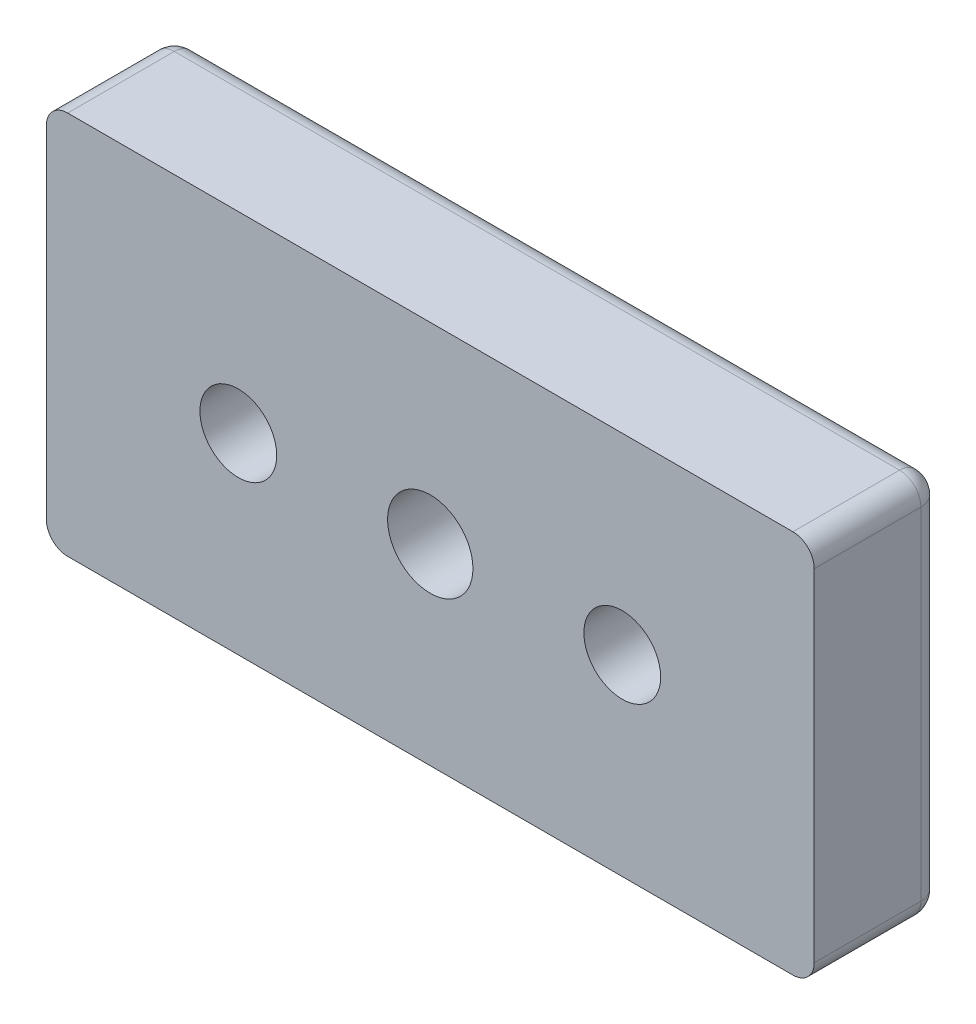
ISO-10303-21;
HEADER;
FILE_DESCRIPTION(('STEP AP214'),'2;1');
FILE_NAME('part.step','',(''),(''),'','','');
FILE_SCHEMA(('AUTOMOTIVE_DESIGN { 1 0 10303 214 1 1 1 1 }'));
ENDSEC;
DATA;
#1=APPLICATION_CONTEXT('core data for automotive mechanical design processes');
#2=APPLICATION_PROTOCOL_DEFINITION('international standard','automotive_design',2000,#1);
#3=PRODUCT_CONTEXT('',#1,'mechanical');
#4=PRODUCT('Part','Part','',(#3));
#5=PRODUCT_RELATED_PRODUCT_CATEGORY('part','',(#4));
#6=PRODUCT_DEFINITION_FORMATION('','',#4);
#7=PRODUCT_DEFINITION_CONTEXT('part definition',#1,'design');
#8=PRODUCT_DEFINITION('design','',#6,#7);
#9=PRODUCT_DEFINITION_SHAPE('','',#8);
#10=(LENGTH_UNIT() NAMED_UNIT(*) SI_UNIT(.MILLI.,.METRE.));
#11=(NAMED_UNIT(*) PLANE_ANGLE_UNIT() SI_UNIT($,.RADIAN.));
#12=(NAMED_UNIT(*) SI_UNIT($,.STERADIAN.) SOLID_ANGLE_UNIT());
#13=UNCERTAINTY_MEASURE_WITH_UNIT(LENGTH_MEASURE(1.E-05),#10,'distance_accuracy_value','');
#14=(GEOMETRIC_REPRESENTATION_CONTEXT(3) GLOBAL_UNCERTAINTY_ASSIGNED_CONTEXT((#13)) GLOBAL_UNIT_ASSIGNED_CONTEXT((#10,
#11,#12)) REPRESENTATION_CONTEXT('',''));
#15=CARTESIAN_POINT('',(0.,0.,0.));
#16=DIRECTION('',(0.,0.,1.));
#17=DIRECTION('',(1.,0.,0.));
#18=AXIS2_PLACEMENT_3D('',#15,#16,#17);
#19=CARTESIAN_POINT('',(22.5,0.,0.));
#20=DIRECTION('',(0.,0.,1.));
#21=DIRECTION('',(1.,0.,0.));
#22=AXIS2_PLACEMENT_3D('',#19,#20,#21);
#23=CYLINDRICAL_SURFACE('',#22,7.5);
#24=CARTESIAN_POINT('',(22.5,0.,5.5));
#25=DIRECTION('',(0.,0.,1.));
#26=DIRECTION('',(1.,0.,0.));
#27=AXIS2_PLACEMENT_3D('',#24,#25,#26);
#28=CIRCLE('',#27,7.5);
#29=CARTESIAN_POINT('',(30.,0.,5.5));
#30=VERTEX_POINT('',#29);
#31=EDGE_CURVE('E111',#30,#30,#28,.T.);
#32=ORIENTED_EDGE('',*,*,#31,.T.);
#33=EDGE_LOOP('',(#32));
#34=FACE_BOUND('',#33,.T.);
#35=CARTESIAN_POINT('',(22.5,0.,0.));
#36=DIRECTION('',(0.,0.,1.));
#37=DIRECTION('',(1.,0.,0.));
#38=AXIS2_PLACEMENT_3D('',#35,#36,#37);
#39=CIRCLE('',#38,7.5);
#40=CARTESIAN_POINT('',(30.,0.,0.));
#41=VERTEX_POINT('',#40);
#42=EDGE_CURVE('E113',#41,#41,#39,.F.);
#43=ORIENTED_EDGE('',*,*,#42,.T.);
#44=EDGE_LOOP('',(#43));
#45=FACE_BOUND('',#44,.T.);
#46=ADVANCED_FACE('F15',(#34,#45),#23,.F.);
#47=CARTESIAN_POINT('',(-22.5,0.,0.));
#48=DIRECTION('',(0.,0.,1.));
#49=DIRECTION('',(1.,0.,0.));
#50=AXIS2_PLACEMENT_3D('',#47,#48,#49);
#51=CYLINDRICAL_SURFACE('',#50,7.5);
#52=CARTESIAN_POINT('',(-22.5,0.,5.5));
#53=DIRECTION('',(0.,0.,1.));
#54=DIRECTION('',(1.,0.,0.));
#55=AXIS2_PLACEMENT_3D('',#52,#53,#54);
#56=CIRCLE('',#55,7.5);
#57=CARTESIAN_POINT('',(-15.,0.,5.5));
#58=VERTEX_POINT('',#57);
#59=EDGE_CURVE('E107',#58,#58,#56,.T.);
#60=ORIENTED_EDGE('',*,*,#59,.T.);
#61=EDGE_LOOP('',(#60));
#62=FACE_BOUND('',#61,.T.);
#63=CARTESIAN_POINT('',(-22.5,0.,0.));
#64=DIRECTION('',(0.,0.,1.));
#65=DIRECTION('',(1.,0.,0.));
#66=AXIS2_PLACEMENT_3D('',#63,#64,#65);
#67=CIRCLE('',#66,7.5);
#68=CARTESIAN_POINT('',(-15.,0.,0.));
#69=VERTEX_POINT('',#68);
#70=EDGE_CURVE('E19',#69,#69,#67,.F.);
#71=ORIENTED_EDGE('',*,*,#70,.T.);
#72=EDGE_LOOP('',(#71));
#73=FACE_BOUND('',#72,.T.);
#74=ADVANCED_FACE('F288',(#62,#73),#51,.F.);
#75=CARTESIAN_POINT('',(-21.25,20.,2.5));
#76=DIRECTION('',(-1.,0.,0.));
#77=DIRECTION('',(0.,0.,1.));
#78=AXIS2_PLACEMENT_3D('',#75,#76,#77);
#79=CYLINDRICAL_SURFACE('',#78,2.5);
#80=CARTESIAN_POINT('',(-42.5,20.,2.5));
#81=DIRECTION('',(1.,0.,0.));
#82=DIRECTION('',(0.,1.,0.));
#83=AXIS2_PLACEMENT_3D('',#80,#81,#82);
#84=CIRCLE('',#83,2.5);
#85=CARTESIAN_POINT('',(-42.5,22.5,2.5));
#86=VERTEX_POINT('',#85);
#87=CARTESIAN_POINT('',(-42.5,20.,0.));
#88=VERTEX_POINT('',#87);
#89=EDGE_CURVE('E235',#86,#88,#84,.F.);
#90=ORIENTED_EDGE('',*,*,#89,.F.);
#91=DIRECTION('',(1.,0.,0.));
#92=VECTOR('',#91,1.);
#93=CARTESIAN_POINT('',(-42.5,22.5,2.5));
#94=LINE('',#93,#92);
#95=CARTESIAN_POINT('',(42.5,22.5,2.5));
#96=VERTEX_POINT('',#95);
#97=EDGE_CURVE('E110',#96,#86,#94,.F.);
#98=ORIENTED_EDGE('',*,*,#97,.F.);
#99=CARTESIAN_POINT('',(42.5,20.,2.5));
#100=DIRECTION('',(1.,0.,0.));
#101=DIRECTION('',(0.,1.,0.));
#102=AXIS2_PLACEMENT_3D('',#99,#100,#101);
#103=CIRCLE('',#102,2.5);
#104=CARTESIAN_POINT('',(42.5,20.,0.));
#105=VERTEX_POINT('',#104);
#106=EDGE_CURVE('E249',#105,#96,#103,.T.);
#107=ORIENTED_EDGE('',*,*,#106,.F.);
#108=DIRECTION('',(1.,0.,0.));
#109=VECTOR('',#108,1.);
#110=CARTESIAN_POINT('',(0.,20.,0.));
#111=LINE('',#110,#109);
#112=EDGE_CURVE('E131',#105,#88,#111,.F.);
#113=ORIENTED_EDGE('',*,*,#112,.T.);
#114=EDGE_LOOP('',(#90,#98,#107,#113));
#115=FACE_BOUND('',#114,.T.);
#116=ADVANCED_FACE('F228',(#115),#79,.T.);
#117=CARTESIAN_POINT('',(-42.5,20.,2.5));
#118=DIRECTION('',(1.,0.,0.));
#119=DIRECTION('',(0.,1.,0.));
#120=AXIS2_PLACEMENT_3D('',#117,#118,#119);
#121=SPHERICAL_SURFACE('',#120,2.5);
#122=CARTESIAN_POINT('',(-42.5,20.,2.5));
#123=DIRECTION('',(0.,0.,1.));
#124=DIRECTION('',(1.,0.,0.));
#125=AXIS2_PLACEMENT_3D('',#122,#123,#124);
#126=CIRCLE('',#125,2.5);
#127=CARTESIAN_POINT('',(-45.,20.,2.5));
#128=VERTEX_POINT('',#127);
#129=EDGE_CURVE('E73',#86,#128,#126,.T.);
#130=ORIENTED_EDGE('',*,*,#129,.F.);
#131=ORIENTED_EDGE('',*,*,#89,.T.);
#132=CARTESIAN_POINT('',(-42.5,20.,2.5));
#133=DIRECTION('',(0.,-1.,0.));
#134=DIRECTION('',(0.,0.,-1.));
#135=AXIS2_PLACEMENT_3D('',#132,#133,#134);
#136=CIRCLE('',#135,2.5);
#137=EDGE_CURVE('E234',#128,#88,#136,.T.);
#138=ORIENTED_EDGE('',*,*,#137,.F.);
#139=EDGE_LOOP('',(#130,#131,#138));
#140=FACE_BOUND('',#139,.T.);
#141=ADVANCED_FACE('F223',(#140),#121,.T.);
#142=CARTESIAN_POINT('',(-42.5,-10.,2.5));
#143=DIRECTION('',(0.,-1.,0.));
#144=DIRECTION('',(0.,0.,-1.));
#145=AXIS2_PLACEMENT_3D('',#142,#143,#144);
#146=CYLINDRICAL_SURFACE('',#145,2.5);
#147=CARTESIAN_POINT('',(-42.5,-20.,2.5));
#148=DIRECTION('',(0.,1.,0.));
#149=DIRECTION('',(1.,0.,0.));
#150=AXIS2_PLACEMENT_3D('',#147,#148,#149);
#151=CIRCLE('',#150,2.5);
#152=CARTESIAN_POINT('',(-45.,-20.,2.5));
#153=VERTEX_POINT('',#152);
#154=CARTESIAN_POINT('',(-42.5,-20.,0.));
#155=VERTEX_POINT('',#154);
#156=EDGE_CURVE('E211',#153,#155,#151,.F.);
#157=ORIENTED_EDGE('',*,*,#156,.F.);
#158=DIRECTION('',(0.,1.,0.));
#159=VECTOR('',#158,1.);
#160=CARTESIAN_POINT('',(-45.,-20.,2.5));
#161=LINE('',#160,#159);
#162=EDGE_CURVE('E77',#128,#153,#161,.F.);
#163=ORIENTED_EDGE('',*,*,#162,.F.);
#164=ORIENTED_EDGE('',*,*,#137,.T.);
#165=DIRECTION('',(0.,1.,0.));
#166=VECTOR('',#165,1.);
#167=CARTESIAN_POINT('',(-42.5,0.,0.));
#168=LINE('',#167,#166);
#169=EDGE_CURVE('E122',#88,#155,#168,.F.);
#170=ORIENTED_EDGE('',*,*,#169,.T.);
#171=EDGE_LOOP('',(#157,#163,#164,#170));
#172=FACE_BOUND('',#171,.T.);
#173=ADVANCED_FACE('F219',(#172),#146,.T.);
#174=CARTESIAN_POINT('',(-42.5,-20.,2.5));
#175=DIRECTION('',(1.,0.,0.));
#176=DIRECTION('',(0.,1.,0.));
#177=AXIS2_PLACEMENT_3D('',#174,#175,#176);
#178=SPHERICAL_SURFACE('',#177,2.5);
#179=CARTESIAN_POINT('',(-42.5,-20.,2.5));
#180=DIRECTION('',(0.,0.,1.));
#181=DIRECTION('',(1.,0.,0.));
#182=AXIS2_PLACEMENT_3D('',#179,#180,#181);
#183=CIRCLE('',#182,2.50000000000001);
#184=CARTESIAN_POINT('',(-42.5,-22.5,2.5));
#185=VERTEX_POINT('',#184);
#186=EDGE_CURVE('E76',#153,#185,#183,.T.);
#187=ORIENTED_EDGE('',*,*,#186,.F.);
#188=ORIENTED_EDGE('',*,*,#156,.T.);
#189=CARTESIAN_POINT('',(-42.5,-20.,2.5));
#190=DIRECTION('',(1.,0.,0.));
#191=DIRECTION('',(0.,0.,-1.));
#192=AXIS2_PLACEMENT_3D('',#189,#190,#191);
#193=CIRCLE('',#192,2.5);
#194=EDGE_CURVE('E207',#185,#155,#193,.T.);
#195=ORIENTED_EDGE('',*,*,#194,.F.);
#196=EDGE_LOOP('',(#187,#188,#195));
#197=FACE_BOUND('',#196,.T.);
#198=ADVANCED_FACE('F216',(#197),#178,.T.);
#199=CARTESIAN_POINT('',(21.25,-20.,2.5));
#200=DIRECTION('',(1.,0.,0.));
#201=DIRECTION('',(0.,0.,-1.));
#202=AXIS2_PLACEMENT_3D('',#199,#200,#201);
#203=CYLINDRICAL_SURFACE('',#202,2.5);
#204=CARTESIAN_POINT('',(42.5,-20.,2.5));
#205=DIRECTION('',(1.,0.,0.));
#206=DIRECTION('',(0.,1.,0.));
#207=AXIS2_PLACEMENT_3D('',#204,#205,#206);
#208=CIRCLE('',#207,2.5);
#209=CARTESIAN_POINT('',(42.5,-22.5,2.50000000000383));
#210=VERTEX_POINT('',#209);
#211=CARTESIAN_POINT('',(42.5,-20.,0.));
#212=VERTEX_POINT('',#211);
#213=EDGE_CURVE('E203',#210,#212,#208,.T.);
#214=ORIENTED_EDGE('',*,*,#213,.F.);
#215=DIRECTION('',(1.,0.,0.));
#216=VECTOR('',#215,1.);
#217=CARTESIAN_POINT('',(42.5,-22.5,2.5));
#218=LINE('',#217,#216);
#219=EDGE_CURVE('E169',#185,#210,#218,.T.);
#220=ORIENTED_EDGE('',*,*,#219,.F.);
#221=ORIENTED_EDGE('',*,*,#194,.T.);
#222=DIRECTION('',(1.,0.,0.));
#223=VECTOR('',#222,1.);
#224=CARTESIAN_POINT('',(0.,-20.,0.));
#225=LINE('',#224,#223);
#226=EDGE_CURVE('E118',#155,#212,#225,.T.);
#227=ORIENTED_EDGE('',*,*,#226,.T.);
#228=EDGE_LOOP('',(#214,#220,#221,#227));
#229=FACE_BOUND('',#228,.T.);
#230=ADVANCED_FACE('F196',(#229),#203,.T.);
#231=CARTESIAN_POINT('',(42.5,-20.,2.5));
#232=DIRECTION('',(1.,0.,0.));
#233=DIRECTION('',(0.,1.,0.));
#234=AXIS2_PLACEMENT_3D('',#231,#232,#233);
#235=SPHERICAL_SURFACE('',#234,2.5);
#236=CARTESIAN_POINT('',(42.5,-20.,2.5));
#237=DIRECTION('',(0.,0.,1.));
#238=DIRECTION('',(1.,0.,0.));
#239=AXIS2_PLACEMENT_3D('',#236,#237,#238);
#240=CIRCLE('',#239,2.5);
#241=CARTESIAN_POINT('',(45.,-20.,2.5));
#242=VERTEX_POINT('',#241);
#243=EDGE_CURVE('E165',#210,#242,#240,.T.);
#244=ORIENTED_EDGE('',*,*,#243,.F.);
#245=ORIENTED_EDGE('',*,*,#213,.T.);
#246=CARTESIAN_POINT('',(42.5,-20.,2.5));
#247=DIRECTION('',(0.,1.,0.));
#248=DIRECTION('',(0.,0.,1.));
#249=AXIS2_PLACEMENT_3D('',#246,#247,#248);
#250=CIRCLE('',#249,2.5);
#251=EDGE_CURVE('E206',#242,#212,#250,.T.);
#252=ORIENTED_EDGE('',*,*,#251,.F.);
#253=EDGE_LOOP('',(#244,#245,#252));
#254=FACE_BOUND('',#253,.T.);
#255=ADVANCED_FACE('F191',(#254),#235,.T.);
#256=CARTESIAN_POINT('',(42.5,10.,2.5));
#257=DIRECTION('',(0.,1.,0.));
#258=DIRECTION('',(0.,0.,1.));
#259=AXIS2_PLACEMENT_3D('',#256,#257,#258);
#260=CYLINDRICAL_SURFACE('',#259,2.5);
#261=CARTESIAN_POINT('',(42.5,20.,2.5));
#262=DIRECTION('',(0.,1.,0.));
#263=DIRECTION('',(1.,0.,0.));
#264=AXIS2_PLACEMENT_3D('',#261,#262,#263);
#265=CIRCLE('',#264,2.5);
#266=CARTESIAN_POINT('',(45.,20.,2.5));
#267=VERTEX_POINT('',#266);
#268=EDGE_CURVE('E178',#267,#105,#265,.T.);
#269=ORIENTED_EDGE('',*,*,#268,.F.);
#270=DIRECTION('',(0.,1.,0.));
#271=VECTOR('',#270,1.);
#272=CARTESIAN_POINT('',(45.,20.,2.5));
#273=LINE('',#272,#271);
#274=EDGE_CURVE('E161',#242,#267,#273,.T.);
#275=ORIENTED_EDGE('',*,*,#274,.F.);
#276=ORIENTED_EDGE('',*,*,#251,.T.);
#277=DIRECTION('',(0.,1.,0.));
#278=VECTOR('',#277,1.);
#279=CARTESIAN_POINT('',(42.5,0.,0.));
#280=LINE('',#279,#278);
#281=EDGE_CURVE('E134',#212,#105,#280,.T.);
#282=ORIENTED_EDGE('',*,*,#281,.T.);
#283=EDGE_LOOP('',(#269,#275,#276,#282));
#284=FACE_BOUND('',#283,.T.);
#285=ADVANCED_FACE('F186',(#284),#260,.T.);
#286=CARTESIAN_POINT('',(42.5,20.,2.5));
#287=DIRECTION('',(1.,0.,0.));
#288=DIRECTION('',(0.,1.,0.));
#289=AXIS2_PLACEMENT_3D('',#286,#287,#288);
#290=SPHERICAL_SURFACE('',#289,2.5);
#291=CARTESIAN_POINT('',(42.5,20.,2.5));
#292=DIRECTION('',(0.,0.,1.));
#293=DIRECTION('',(1.,0.,0.));
#294=AXIS2_PLACEMENT_3D('',#291,#292,#293);
#295=CIRCLE('',#294,2.5);
#296=EDGE_CURVE('E156',#267,#96,#295,.T.);
#297=ORIENTED_EDGE('',*,*,#296,.F.);
#298=ORIENTED_EDGE('',*,*,#268,.T.);
#299=ORIENTED_EDGE('',*,*,#106,.T.);
#300=EDGE_LOOP('',(#297,#298,#299));
#301=FACE_BOUND('',#300,.T.);
#302=ADVANCED_FACE('F181',(#301),#290,.T.);
#303=CARTESIAN_POINT('',(0.,0.,0.));
#304=DIRECTION('',(0.,0.,1.));
#305=DIRECTION('',(1.,0.,0.));
#306=AXIS2_PLACEMENT_3D('',#303,#304,#305);
#307=PLANE('',#306);
#308=ORIENTED_EDGE('',*,*,#42,.F.);
#309=EDGE_LOOP('',(#308));
#310=FACE_BOUND('',#309,.T.);
#311=ORIENTED_EDGE('',*,*,#70,.F.);
#312=EDGE_LOOP('',(#311));
#313=FACE_BOUND('',#312,.T.);
#314=CARTESIAN_POINT('',(0.,0.,0.));
#315=DIRECTION('',(0.,0.,1.));
#316=DIRECTION('',(1.,0.,0.));
#317=AXIS2_PLACEMENT_3D('',#314,#315,#316);
#318=CIRCLE('',#317,5.);
#319=CARTESIAN_POINT('',(5.,0.,0.));
#320=VERTEX_POINT('',#319);
#321=EDGE_CURVE('E104',#320,#320,#318,.T.);
#322=ORIENTED_EDGE('',*,*,#321,.T.);
#323=EDGE_LOOP('',(#322));
#324=FACE_BOUND('',#323,.T.);
#325=ORIENTED_EDGE('',*,*,#169,.F.);
#326=ORIENTED_EDGE('',*,*,#112,.F.);
#327=ORIENTED_EDGE('',*,*,#281,.F.);
#328=ORIENTED_EDGE('',*,*,#226,.F.);
#329=EDGE_LOOP('',(#325,#326,#327,#328));
#330=FACE_BOUND('',#329,.T.);
#331=ADVANCED_FACE('F185',(#310,#313,#324,#330),#307,.F.);
#332=CARTESIAN_POINT('',(30.15,7.65,5.5));
#333=DIRECTION('',(0.,0.,1.));
#334=DIRECTION('',(-1.,0.,0.));
#335=AXIS2_PLACEMENT_3D('',#332,#333,#334);
#336=PLANE('',#335);
#337=CARTESIAN_POINT('',(22.5,0.,5.5));
#338=DIRECTION('',(0.,0.,1.));
#339=DIRECTION('',(1.,0.,0.));
#340=AXIS2_PLACEMENT_3D('',#337,#338,#339);
#341=CIRCLE('',#340,4.5);
#342=CARTESIAN_POINT('',(27.,0.,5.5));
#343=VERTEX_POINT('',#342);
#344=EDGE_CURVE('E101',#343,#343,#341,.T.);
#345=ORIENTED_EDGE('',*,*,#344,.T.);
#346=EDGE_LOOP('',(#345));
#347=FACE_BOUND('',#346,.T.);
#348=ORIENTED_EDGE('',*,*,#31,.F.);
#349=EDGE_LOOP('',(#348));
#350=FACE_BOUND('',#349,.T.);
#351=ADVANCED_FACE('F335',(#347,#350),#336,.F.);
#352=CARTESIAN_POINT('',(-14.85,7.65,5.5));
#353=DIRECTION('',(0.,0.,1.));
#354=DIRECTION('',(-1.,0.,0.));
#355=AXIS2_PLACEMENT_3D('',#352,#353,#354);
#356=PLANE('',#355);
#357=CARTESIAN_POINT('',(-22.5,0.,5.5));
#358=DIRECTION('',(0.,0.,1.));
#359=DIRECTION('',(1.,0.,0.));
#360=AXIS2_PLACEMENT_3D('',#357,#358,#359);
#361=CIRCLE('',#360,4.5);
#362=CARTESIAN_POINT('',(-18.,0.,5.5));
#363=VERTEX_POINT('',#362);
#364=EDGE_CURVE('E94',#363,#363,#361,.T.);
#365=ORIENTED_EDGE('',*,*,#364,.T.);
#366=EDGE_LOOP('',(#365));
#367=FACE_BOUND('',#366,.T.);
#368=ORIENTED_EDGE('',*,*,#59,.F.);
#369=EDGE_LOOP('',(#368));
#370=FACE_BOUND('',#369,.T.);
#371=ADVANCED_FACE('F17',(#367,#370),#356,.F.);
#372=CARTESIAN_POINT('',(-42.5,22.5,0.));
#373=DIRECTION('',(0.,1.,0.));
#374=DIRECTION('',(0.,0.,1.));
#375=AXIS2_PLACEMENT_3D('',#372,#373,#374);
#376=PLANE('',#375);
#377=DIRECTION('',(1.,0.,0.));
#378=VECTOR('',#377,1.);
#379=CARTESIAN_POINT('',(0.,22.5,15.));
#380=LINE('',#379,#378);
#381=CARTESIAN_POINT('',(42.5,22.5,15.));
#382=VERTEX_POINT('',#381);
#383=CARTESIAN_POINT('',(-42.5,22.5,15.));
#384=VERTEX_POINT('',#383);
#385=EDGE_CURVE('E92',#382,#384,#380,.F.);
#386=ORIENTED_EDGE('',*,*,#385,.F.);
#387=DIRECTION('',(0.,0.,1.));
#388=VECTOR('',#387,1.);
#389=CARTESIAN_POINT('',(42.5,22.5,0.));
#390=LINE('',#389,#388);
#391=EDGE_CURVE('E153',#96,#382,#390,.T.);
#392=ORIENTED_EDGE('',*,*,#391,.F.);
#393=ORIENTED_EDGE('',*,*,#97,.T.);
#394=DIRECTION('',(0.,0.,1.));
#395=VECTOR('',#394,1.);
#396=CARTESIAN_POINT('',(-42.5,22.5,0.));
#397=LINE('',#396,#395);
#398=EDGE_CURVE('E59',#384,#86,#397,.F.);
#399=ORIENTED_EDGE('',*,*,#398,.F.);
#400=EDGE_LOOP('',(#386,#392,#393,#399));
#401=FACE_BOUND('',#400,.T.);
#402=ADVANCED_FACE('F268',(#401),#376,.T.);
#403=CARTESIAN_POINT('',(-42.5,20.,0.));
#404=DIRECTION('',(0.,0.,1.));
#405=DIRECTION('',(1.,0.,0.));
#406=AXIS2_PLACEMENT_3D('',#403,#404,#405);
#407=CYLINDRICAL_SURFACE('',#406,2.5);
#408=CARTESIAN_POINT('',(-42.5,20.,15.));
#409=DIRECTION('',(0.,0.,1.));
#410=DIRECTION('',(1.,0.,0.));
#411=AXIS2_PLACEMENT_3D('',#408,#409,#410);
#412=CIRCLE('',#411,2.5);
#413=CARTESIAN_POINT('',(-45.,20.,15.));
#414=VERTEX_POINT('',#413);
#415=EDGE_CURVE('E69',#384,#414,#412,.T.);
#416=ORIENTED_EDGE('',*,*,#415,.F.);
#417=ORIENTED_EDGE('',*,*,#398,.T.);
#418=ORIENTED_EDGE('',*,*,#129,.T.);
#419=DIRECTION('',(0.,0.,1.));
#420=VECTOR('',#419,1.);
#421=CARTESIAN_POINT('',(-45.,20.,0.));
#422=LINE('',#421,#420);
#423=EDGE_CURVE('E65',#414,#128,#422,.F.);
#424=ORIENTED_EDGE('',*,*,#423,.F.);
#425=EDGE_LOOP('',(#416,#417,#418,#424));
#426=FACE_BOUND('',#425,.T.);
#427=ADVANCED_FACE('F67',(#426),#407,.T.);
#428=CARTESIAN_POINT('',(-45.,-20.,0.));
#429=DIRECTION('',(-1.,0.,0.));
#430=DIRECTION('',(0.,0.,1.));
#431=AXIS2_PLACEMENT_3D('',#428,#429,#430);
#432=PLANE('',#431);
#433=DIRECTION('',(0.,1.,0.));
#434=VECTOR('',#433,1.);
#435=CARTESIAN_POINT('',(-45.,0.,15.));
#436=LINE('',#435,#434);
#437=CARTESIAN_POINT('',(-45.,-20.,15.));
#438=VERTEX_POINT('',#437);
#439=EDGE_CURVE('E80',#414,#438,#436,.F.);
#440=ORIENTED_EDGE('',*,*,#439,.F.);
#441=ORIENTED_EDGE('',*,*,#423,.T.);
#442=ORIENTED_EDGE('',*,*,#162,.T.);
#443=DIRECTION('',(0.,0.,1.));
#444=VECTOR('',#443,1.);
#445=CARTESIAN_POINT('',(-45.,-20.,0.));
#446=LINE('',#445,#444);
#447=EDGE_CURVE('E83',#438,#153,#446,.F.);
#448=ORIENTED_EDGE('',*,*,#447,.F.);
#449=EDGE_LOOP('',(#440,#441,#442,#448));
#450=FACE_BOUND('',#449,.T.);
#451=ADVANCED_FACE('F81',(#450),#432,.T.);
#452=CARTESIAN_POINT('',(-42.5,-20.,0.));
#453=DIRECTION('',(0.,0.,1.));
#454=DIRECTION('',(1.,0.,0.));
#455=AXIS2_PLACEMENT_3D('',#452,#453,#454);
#456=CYLINDRICAL_SURFACE('',#455,2.50000000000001);
#457=CARTESIAN_POINT('',(-42.5,-20.,15.));
#458=DIRECTION('',(0.,0.,1.));
#459=DIRECTION('',(1.,0.,0.));
#460=AXIS2_PLACEMENT_3D('',#457,#458,#459);
#461=CIRCLE('',#460,2.50000000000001);
#462=CARTESIAN_POINT('',(-42.5,-22.5,15.));
#463=VERTEX_POINT('',#462);
#464=EDGE_CURVE('E87',#438,#463,#461,.T.);
#465=ORIENTED_EDGE('',*,*,#464,.F.);
#466=ORIENTED_EDGE('',*,*,#447,.T.);
#467=ORIENTED_EDGE('',*,*,#186,.T.);
#468=DIRECTION('',(0.,0.,-1.));
#469=VECTOR('',#468,1.);
#470=CARTESIAN_POINT('',(-42.5,-22.5,0.));
#471=LINE('',#470,#469);
#472=EDGE_CURVE('E166',#463,#185,#471,.T.);
#473=ORIENTED_EDGE('',*,*,#472,.F.);
#474=EDGE_LOOP('',(#465,#466,#467,#473));
#475=FACE_BOUND('',#474,.T.);
#476=ADVANCED_FACE('F323',(#475),#456,.T.);
#477=CARTESIAN_POINT('',(42.5,-22.5,0.));
#478=DIRECTION('',(0.,-1.,0.));
#479=DIRECTION('',(0.,0.,-1.));
#480=AXIS2_PLACEMENT_3D('',#477,#478,#479);
#481=PLANE('',#480);
#482=DIRECTION('',(1.,0.,0.));
#483=VECTOR('',#482,1.);
#484=CARTESIAN_POINT('',(0.,-22.5,15.));
#485=LINE('',#484,#483);
#486=CARTESIAN_POINT('',(42.5,-22.5,15.));
#487=VERTEX_POINT('',#486);
#488=EDGE_CURVE('E146',#463,#487,#485,.T.);
#489=ORIENTED_EDGE('',*,*,#488,.F.);
#490=ORIENTED_EDGE('',*,*,#472,.T.);
#491=ORIENTED_EDGE('',*,*,#219,.T.);
#492=DIRECTION('',(0.,0.,1.));
#493=VECTOR('',#492,1.);
#494=CARTESIAN_POINT('',(42.5,-22.5,0.));
#495=LINE('',#494,#493);
#496=EDGE_CURVE('E162',#487,#210,#495,.F.);
#497=ORIENTED_EDGE('',*,*,#496,.F.);
#498=EDGE_LOOP('',(#489,#490,#491,#497));
#499=FACE_BOUND('',#498,.T.);
#500=ADVANCED_FACE('F320',(#499),#481,.T.);
#501=CARTESIAN_POINT('',(42.5,-20.,0.));
#502=DIRECTION('',(0.,0.,1.));
#503=DIRECTION('',(1.,0.,0.));
#504=AXIS2_PLACEMENT_3D('',#501,#502,#503);
#505=CYLINDRICAL_SURFACE('',#504,2.5);
#506=CARTESIAN_POINT('',(42.5,-20.,15.));
#507=DIRECTION('',(0.,0.,1.));
#508=DIRECTION('',(1.,0.,0.));
#509=AXIS2_PLACEMENT_3D('',#506,#507,#508);
#510=CIRCLE('',#509,2.5);
#511=CARTESIAN_POINT('',(45.,-20.,15.));
#512=VERTEX_POINT('',#511);
#513=EDGE_CURVE('E144',#487,#512,#510,.T.);
#514=ORIENTED_EDGE('',*,*,#513,.F.);
#515=ORIENTED_EDGE('',*,*,#496,.T.);
#516=ORIENTED_EDGE('',*,*,#243,.T.);
#517=DIRECTION('',(0.,0.,-1.));
#518=VECTOR('',#517,1.);
#519=CARTESIAN_POINT('',(45.,-20.,0.));
#520=LINE('',#519,#518);
#521=EDGE_CURVE('E158',#512,#242,#520,.T.);
#522=ORIENTED_EDGE('',*,*,#521,.F.);
#523=EDGE_LOOP('',(#514,#515,#516,#522));
#524=FACE_BOUND('',#523,.T.);
#525=ADVANCED_FACE('F258',(#524),#505,.T.);
#526=CARTESIAN_POINT('',(45.,20.,0.));
#527=DIRECTION('',(1.,0.,0.));
#528=DIRECTION('',(0.,0.,-1.));
#529=AXIS2_PLACEMENT_3D('',#526,#527,#528);
#530=PLANE('',#529);
#531=DIRECTION('',(0.,1.,0.));
#532=VECTOR('',#531,1.);
#533=CARTESIAN_POINT('',(45.,0.,15.));
#534=LINE('',#533,#532);
#535=CARTESIAN_POINT('',(45.,20.,15.));
#536=VERTEX_POINT('',#535);
#537=EDGE_CURVE('E143',#512,#536,#534,.T.);
#538=ORIENTED_EDGE('',*,*,#537,.F.);
#539=ORIENTED_EDGE('',*,*,#521,.T.);
#540=ORIENTED_EDGE('',*,*,#274,.T.);
#541=DIRECTION('',(0.,0.,1.));
#542=VECTOR('',#541,1.);
#543=CARTESIAN_POINT('',(45.,20.,0.));
#544=LINE('',#543,#542);
#545=EDGE_CURVE('E34',#536,#267,#544,.F.);
#546=ORIENTED_EDGE('',*,*,#545,.F.);
#547=EDGE_LOOP('',(#538,#539,#540,#546));
#548=FACE_BOUND('',#547,.T.);
#549=ADVANCED_FACE('F264',(#548),#530,.T.);
#550=CARTESIAN_POINT('',(42.5,20.,0.));
#551=DIRECTION('',(0.,0.,1.));
#552=DIRECTION('',(1.,0.,0.));
#553=AXIS2_PLACEMENT_3D('',#550,#551,#552);
#554=CYLINDRICAL_SURFACE('',#553,2.5);
#555=CARTESIAN_POINT('',(42.5,20.,15.));
#556=DIRECTION('',(0.,0.,1.));
#557=DIRECTION('',(1.,0.,0.));
#558=AXIS2_PLACEMENT_3D('',#555,#556,#557);
#559=CIRCLE('',#558,2.5);
#560=EDGE_CURVE('E142',#536,#382,#559,.T.);
#561=ORIENTED_EDGE('',*,*,#560,.F.);
#562=ORIENTED_EDGE('',*,*,#545,.T.);
#563=ORIENTED_EDGE('',*,*,#296,.T.);
#564=ORIENTED_EDGE('',*,*,#391,.T.);
#565=EDGE_LOOP('',(#561,#562,#563,#564));
#566=FACE_BOUND('',#565,.T.);
#567=ADVANCED_FACE('F267',(#566),#554,.T.);
#568=CARTESIAN_POINT('',(0.,0.,0.));
#569=DIRECTION('',(0.,0.,1.));
#570=DIRECTION('',(1.,0.,0.));
#571=AXIS2_PLACEMENT_3D('',#568,#569,#570);
#572=CYLINDRICAL_SURFACE('',#571,5.);
#573=ORIENTED_EDGE('',*,*,#321,.F.);
#574=EDGE_LOOP('',(#573));
#575=FACE_BOUND('',#574,.T.);
#576=CARTESIAN_POINT('',(0.,0.,15.));
#577=DIRECTION('',(0.,0.,1.));
#578=DIRECTION('',(1.,0.,0.));
#579=AXIS2_PLACEMENT_3D('',#576,#577,#578);
#580=CIRCLE('',#579,5.);
#581=CARTESIAN_POINT('',(5.,0.,15.));
#582=VERTEX_POINT('',#581);
#583=EDGE_CURVE('E139',#582,#582,#580,.F.);
#584=ORIENTED_EDGE('',*,*,#583,.F.);
#585=EDGE_LOOP('',(#584));
#586=FACE_BOUND('',#585,.T.);
#587=ADVANCED_FACE('F309',(#575,#586),#572,.F.);
#588=CARTESIAN_POINT('',(22.5,0.,0.));
#589=DIRECTION('',(0.,0.,1.));
#590=DIRECTION('',(1.,0.,0.));
#591=AXIS2_PLACEMENT_3D('',#588,#589,#590);
#592=CYLINDRICAL_SURFACE('',#591,4.5);
#593=CARTESIAN_POINT('',(22.5,0.,15.));
#594=DIRECTION('',(0.,0.,1.));
#595=DIRECTION('',(1.,0.,0.));
#596=AXIS2_PLACEMENT_3D('',#593,#594,#595);
#597=CIRCLE('',#596,4.5);
#598=CARTESIAN_POINT('',(27.,0.,15.));
#599=VERTEX_POINT('',#598);
#600=EDGE_CURVE('E25',#599,#599,#597,.F.);
#601=ORIENTED_EDGE('',*,*,#600,.F.);
#602=EDGE_LOOP('',(#601));
#603=FACE_BOUND('',#602,.T.);
#604=ORIENTED_EDGE('',*,*,#344,.F.);
#605=EDGE_LOOP('',(#604));
#606=FACE_BOUND('',#605,.T.);
#607=ADVANCED_FACE('F302',(#603,#606),#592,.F.);
#608=CARTESIAN_POINT('',(-22.5,0.,0.));
#609=DIRECTION('',(0.,0.,1.));
#610=DIRECTION('',(1.,0.,0.));
#611=AXIS2_PLACEMENT_3D('',#608,#609,#610);
#612=CYLINDRICAL_SURFACE('',#611,4.5);
#613=CARTESIAN_POINT('',(-22.5,0.,15.));
#614=DIRECTION('',(0.,0.,1.));
#615=DIRECTION('',(1.,0.,0.));
#616=AXIS2_PLACEMENT_3D('',#613,#614,#615);
#617=CIRCLE('',#616,4.5);
#618=CARTESIAN_POINT('',(-18.,0.,15.));
#619=VERTEX_POINT('',#618);
#620=EDGE_CURVE('E10',#619,#619,#617,.F.);
#621=ORIENTED_EDGE('',*,*,#620,.F.);
#622=EDGE_LOOP('',(#621));
#623=FACE_BOUND('',#622,.T.);
#624=ORIENTED_EDGE('',*,*,#364,.F.);
#625=EDGE_LOOP('',(#624));
#626=FACE_BOUND('',#625,.T.);
#627=ADVANCED_FACE('F296',(#623,#626),#612,.F.);
#628=CARTESIAN_POINT('',(0.,0.,15.));
#629=DIRECTION('',(0.,0.,1.));
#630=DIRECTION('',(1.,0.,0.));
#631=AXIS2_PLACEMENT_3D('',#628,#629,#630);
#632=PLANE('',#631);
#633=ORIENTED_EDGE('',*,*,#620,.T.);
#634=EDGE_LOOP('',(#633));
#635=FACE_BOUND('',#634,.T.);
#636=ORIENTED_EDGE('',*,*,#600,.T.);
#637=EDGE_LOOP('',(#636));
#638=FACE_BOUND('',#637,.T.);
#639=ORIENTED_EDGE('',*,*,#583,.T.);
#640=EDGE_LOOP('',(#639));
#641=FACE_BOUND('',#640,.T.);
#642=ORIENTED_EDGE('',*,*,#537,.T.);
#643=ORIENTED_EDGE('',*,*,#560,.T.);
#644=ORIENTED_EDGE('',*,*,#385,.T.);
#645=ORIENTED_EDGE('',*,*,#415,.T.);
#646=ORIENTED_EDGE('',*,*,#439,.T.);
#647=ORIENTED_EDGE('',*,*,#464,.T.);
#648=ORIENTED_EDGE('',*,*,#488,.T.);
#649=ORIENTED_EDGE('',*,*,#513,.T.);
#650=EDGE_LOOP('',(#642,#643,#644,#645,#646,#647,#648,#649));
#651=FACE_BOUND('',#650,.T.);
#652=ADVANCED_FACE('F90',(#635,#638,#641,#651),#632,.T.);
#653=CLOSED_SHELL('',(#46,#74,#116,#141,#173,#198,#230,#255,#285,#302,#331,#351,#371,#402,#427,
#451,#476,#500,#525,#549,#567,#587,#607,#627,#652));
#654=MANIFOLD_SOLID_BREP('B1',#653);
#655=ADVANCED_BREP_SHAPE_REPRESENTATION('',(#18,#654),#14);
#656=SHAPE_DEFINITION_REPRESENTATION(#9,#655);
ENDSEC;
END-ISO-10303-21;
